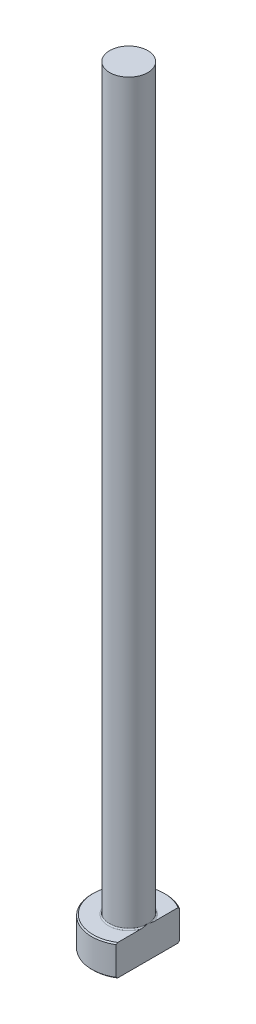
ISO-10303-21;
HEADER;
FILE_DESCRIPTION(('STEP AP214'),'2;1');
FILE_NAME('part.step','',(''),(''),'','','');
FILE_SCHEMA(('AUTOMOTIVE_DESIGN { 1 0 10303 214 1 1 1 1 }'));
ENDSEC;
DATA;
#1=APPLICATION_CONTEXT('core data for automotive mechanical design processes');
#2=APPLICATION_PROTOCOL_DEFINITION('international standard','automotive_design',2000,#1);
#3=PRODUCT_CONTEXT('',#1,'mechanical');
#4=PRODUCT('Part','Part','',(#3));
#5=PRODUCT_RELATED_PRODUCT_CATEGORY('part','',(#4));
#6=PRODUCT_DEFINITION_FORMATION('','',#4);
#7=PRODUCT_DEFINITION_CONTEXT('part definition',#1,'design');
#8=PRODUCT_DEFINITION('design','',#6,#7);
#9=PRODUCT_DEFINITION_SHAPE('','',#8);
#10=(LENGTH_UNIT() NAMED_UNIT(*) SI_UNIT(.MILLI.,.METRE.));
#11=(NAMED_UNIT(*) PLANE_ANGLE_UNIT() SI_UNIT($,.RADIAN.));
#12=(NAMED_UNIT(*) SI_UNIT($,.STERADIAN.) SOLID_ANGLE_UNIT());
#13=UNCERTAINTY_MEASURE_WITH_UNIT(LENGTH_MEASURE(1.E-05),#10,'distance_accuracy_value','');
#14=(GEOMETRIC_REPRESENTATION_CONTEXT(3) GLOBAL_UNCERTAINTY_ASSIGNED_CONTEXT((#13)) GLOBAL_UNIT_ASSIGNED_CONTEXT((#10,
#11,#12)) REPRESENTATION_CONTEXT('',''));
#15=CARTESIAN_POINT('',(0.,0.,0.));
#16=DIRECTION('',(0.,0.,1.));
#17=DIRECTION('',(1.,0.,0.));
#18=AXIS2_PLACEMENT_3D('',#15,#16,#17);
#19=CARTESIAN_POINT('',(0.,0.,0.));
#20=DIRECTION('',(0.,-1.,0.));
#21=DIRECTION('',(0.,0.,-1.));
#22=AXIS2_PLACEMENT_3D('',#19,#20,#21);
#23=PLANE('',#22);
#24=CARTESIAN_POINT('',(0.,0.,0.));
#25=DIRECTION('',(0.,-1.,0.));
#26=DIRECTION('',(0.,0.,-1.));
#27=AXIS2_PLACEMENT_3D('',#24,#25,#26);
#28=CIRCLE('',#27,5.79999999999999);
#29=CARTESIAN_POINT('',(3.09999999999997,0.,4.90204039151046));
#30=VERTEX_POINT('',#29);
#31=CARTESIAN_POINT('',(3.09999999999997,0.,-4.90204039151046));
#32=VERTEX_POINT('',#31);
#33=EDGE_CURVE('E98',#30,#32,#28,.T.);
#34=ORIENTED_EDGE('',*,*,#33,.T.);
#35=DIRECTION('',(0.,0.,1.));
#36=VECTOR('',#35,1.);
#37=CARTESIAN_POINT('',(3.09999999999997,0.,-5.13711981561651));
#38=LINE('',#37,#36);
#39=EDGE_CURVE('E83',#32,#30,#38,.T.);
#40=ORIENTED_EDGE('',*,*,#39,.T.);
#41=EDGE_LOOP('',(#34,#40));
#42=FACE_BOUND('',#41,.T.);
#43=ADVANCED_FACE('F32',(#42),#23,.T.);
#44=CARTESIAN_POINT('',(0.,259.958771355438,0.));
#45=DIRECTION('',(0.,1.,0.));
#46=DIRECTION('',(0.,0.,1.));
#47=AXIS2_PLACEMENT_3D('',#44,#45,#46);
#48=CYLINDRICAL_SURFACE('',#47,5.99999999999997);
#49=CARTESIAN_POINT('',(0.,4.79999999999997,0.));
#50=DIRECTION('',(0.,1.,0.));
#51=DIRECTION('',(0.,0.,1.));
#52=AXIS2_PLACEMENT_3D('',#49,#50,#51);
#53=CIRCLE('',#52,5.99999999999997);
#54=CARTESIAN_POINT('',(3.09999999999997,4.79999999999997,5.13711981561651));
#55=VERTEX_POINT('',#54);
#56=CARTESIAN_POINT('',(3.09999999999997,4.79999999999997,-5.13711981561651));
#57=VERTEX_POINT('',#56);
#58=EDGE_CURVE('E104',#55,#57,#53,.F.);
#59=ORIENTED_EDGE('',*,*,#58,.T.);
#60=DIRECTION('',(0.,-1.,0.));
#61=VECTOR('',#60,1.);
#62=CARTESIAN_POINT('',(3.09999999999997,125.,-5.13711981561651));
#63=LINE('',#62,#61);
#64=CARTESIAN_POINT('',(3.09999999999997,0.199999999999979,-5.13711981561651));
#65=VERTEX_POINT('',#64);
#66=EDGE_CURVE('E183',#57,#65,#63,.T.);
#67=ORIENTED_EDGE('',*,*,#66,.T.);
#68=CARTESIAN_POINT('',(0.,0.199999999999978,0.));
#69=DIRECTION('',(0.,-1.,0.));
#70=DIRECTION('',(0.,0.,-1.));
#71=AXIS2_PLACEMENT_3D('',#68,#69,#70);
#72=CIRCLE('',#71,5.99999999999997);
#73=CARTESIAN_POINT('',(3.09999999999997,0.199999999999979,5.13711981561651));
#74=VERTEX_POINT('',#73);
#75=EDGE_CURVE('E100',#65,#74,#72,.F.);
#76=ORIENTED_EDGE('',*,*,#75,.T.);
#77=DIRECTION('',(0.,-1.,0.));
#78=VECTOR('',#77,1.);
#79=CARTESIAN_POINT('',(3.09999999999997,125.,5.13711981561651));
#80=LINE('',#79,#78);
#81=EDGE_CURVE('E93',#55,#74,#80,.T.);
#82=ORIENTED_EDGE('',*,*,#81,.F.);
#83=EDGE_LOOP('',(#59,#67,#76,#82));
#84=FACE_BOUND('',#83,.T.);
#85=ADVANCED_FACE('F158',(#84),#48,.T.);
#86=CARTESIAN_POINT('',(-5.99999999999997,5.,0.));
#87=DIRECTION('',(0.,1.,0.));
#88=DIRECTION('',(0.,0.,1.));
#89=AXIS2_PLACEMENT_3D('',#86,#87,#88);
#90=PLANE('',#89);
#91=CARTESIAN_POINT('',(0.,5.,0.));
#92=DIRECTION('',(0.,1.,0.));
#93=DIRECTION('',(0.,0.,1.));
#94=AXIS2_PLACEMENT_3D('',#91,#92,#93);
#95=CIRCLE('',#94,5.79999999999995);
#96=CARTESIAN_POINT('',(3.09999999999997,5.,-4.90204039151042));
#97=VERTEX_POINT('',#96);
#98=CARTESIAN_POINT('',(3.09999999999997,5.,4.90204039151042));
#99=VERTEX_POINT('',#98);
#100=EDGE_CURVE('E178',#97,#99,#95,.T.);
#101=ORIENTED_EDGE('',*,*,#100,.T.);
#102=DIRECTION('',(0.,0.,-1.));
#103=VECTOR('',#102,1.);
#104=CARTESIAN_POINT('',(3.09999999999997,5.,0.));
#105=LINE('',#104,#103);
#106=CARTESIAN_POINT('',(3.09999999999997,4.99999999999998,1.13137084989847));
#107=VERTEX_POINT('',#106);
#108=EDGE_CURVE('E57',#99,#107,#105,.T.);
#109=ORIENTED_EDGE('',*,*,#108,.T.);
#110=CARTESIAN_POINT('',(0.,5.,0.));
#111=DIRECTION('',(0.,1.,0.));
#112=DIRECTION('',(0.,0.,1.));
#113=AXIS2_PLACEMENT_3D('',#110,#111,#112);
#114=CIRCLE('',#113,3.29999999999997);
#115=CARTESIAN_POINT('',(3.09999999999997,4.99999999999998,-1.13137084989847));
#116=VERTEX_POINT('',#115);
#117=EDGE_CURVE('E107',#107,#116,#114,.F.);
#118=ORIENTED_EDGE('',*,*,#117,.T.);
#119=EDGE_CURVE('E136',#116,#97,#105,.T.);
#120=ORIENTED_EDGE('',*,*,#119,.T.);
#121=EDGE_LOOP('',(#101,#109,#118,#120));
#122=FACE_BOUND('',#121,.T.);
#123=ADVANCED_FACE('F147',(#122),#90,.T.);
#124=CARTESIAN_POINT('',(0.,5.,0.));
#125=DIRECTION('',(0.,-1.,0.));
#126=DIRECTION('',(0.,0.,-1.));
#127=AXIS2_PLACEMENT_3D('',#124,#125,#126);
#128=CONICAL_SURFACE('',#127,5.79999999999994,0.785398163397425);
#129=ORIENTED_EDGE('',*,*,#58,.F.);
#130=CARTESIAN_POINT('',(3.09999999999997,-0.920431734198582,11.3030314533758));
#131=CARTESIAN_POINT('',(3.09999999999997,-0.688619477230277,11.0626468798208));
#132=CARTESIAN_POINT('',(3.09999999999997,-0.457063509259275,10.822014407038));
#133=CARTESIAN_POINT('',(3.09999999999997,0.00539791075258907,10.340120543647));
#134=CARTESIAN_POINT('',(3.09999999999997,0.236303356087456,10.0988591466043));
#135=CARTESIAN_POINT('',(3.09999999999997,0.697410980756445,9.61548494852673));
#136=CARTESIAN_POINT('',(3.09999999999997,0.92761285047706,9.37337185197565));
#137=CARTESIAN_POINT('',(3.09999999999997,1.38702344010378,8.88820676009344));
#138=CARTESIAN_POINT('',(3.09999999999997,1.6162321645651,8.64515476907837));
#139=CARTESIAN_POINT('',(3.09999999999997,2.0694380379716,8.16208218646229));
#140=CARTESIAN_POINT('',(3.09999999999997,2.29345676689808,7.92208185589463));
#141=CARTESIAN_POINT('',(3.09999999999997,2.73992554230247,7.44062694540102));
#142=CARTESIAN_POINT('',(3.09999999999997,2.96237559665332,7.19917237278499));
#143=CARTESIAN_POINT('',(3.09999999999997,3.40516728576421,6.71440911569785));
#144=CARTESIAN_POINT('',(3.09999999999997,3.62550926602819,6.47110074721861));
#145=CARTESIAN_POINT('',(3.09999999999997,4.06338097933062,5.98197014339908));
#146=CARTESIAN_POINT('',(3.09999999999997,4.28091078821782,5.7361479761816));
#147=CARTESIAN_POINT('',(3.09999999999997,4.64723250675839,5.31542741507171));
#148=CARTESIAN_POINT('',(3.09999999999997,4.79703819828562,5.14141294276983));
#149=CARTESIAN_POINT('',(3.09999999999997,5.09412273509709,4.79120565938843));
#150=CARTESIAN_POINT('',(3.09999999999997,5.24140133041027,4.61501263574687));
#151=CARTESIAN_POINT('',(3.09999999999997,5.53400477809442,4.25808346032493));
#152=CARTESIAN_POINT('',(3.09999999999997,5.67929603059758,4.07731963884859));
#153=CARTESIAN_POINT('',(3.09999999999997,5.96506147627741,3.71208453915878));
#154=CARTESIAN_POINT('',(3.09999999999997,6.1055368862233,3.52761421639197));
#155=CARTESIAN_POINT('',(3.09999999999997,6.38162972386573,3.15098880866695));
#156=CARTESIAN_POINT('',(3.09999999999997,6.51715077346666,2.95876205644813));
#157=CARTESIAN_POINT('',(3.09999999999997,6.7126004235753,2.66498269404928));
#158=CARTESIAN_POINT('',(3.09999999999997,6.77649142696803,2.56607098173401));
#159=CARTESIAN_POINT('',(3.09999999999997,6.90093996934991,2.3661793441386));
#160=CARTESIAN_POINT('',(3.09999999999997,6.96149785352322,2.26519963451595));
#161=CARTESIAN_POINT('',(3.09999999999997,7.07778312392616,2.06197879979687));
#162=CARTESIAN_POINT('',(3.09999999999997,7.13355741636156,1.95976487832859));
#163=CARTESIAN_POINT('',(3.09999999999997,7.23993773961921,1.75269687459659));
#164=CARTESIAN_POINT('',(3.09999999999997,7.29054278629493,1.64784229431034));
#165=CARTESIAN_POINT('',(3.09999999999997,7.43232844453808,1.32937424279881));
#166=CARTESIAN_POINT('',(3.09999999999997,7.51393038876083,1.11110705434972));
#167=CARTESIAN_POINT('',(3.09999999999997,7.60389052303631,0.784181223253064));
#168=CARTESIAN_POINT('',(3.09999999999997,7.62802295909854,0.679829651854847));
#169=CARTESIAN_POINT('',(3.09999999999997,7.66638713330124,0.469284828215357));
#170=CARTESIAN_POINT('',(3.09999999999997,7.68061997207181,0.363091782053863));
#171=CARTESIAN_POINT('',(3.09999999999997,7.6981673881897,0.150218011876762));
#172=CARTESIAN_POINT('',(3.09999999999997,7.70152516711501,0.0435409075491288));
#173=CARTESIAN_POINT('',(3.09999999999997,7.6971936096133,-0.169591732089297));
#174=CARTESIAN_POINT('',(3.09999999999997,7.68950359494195,-0.276047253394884));
#175=CARTESIAN_POINT('',(3.09999999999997,7.66373252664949,-0.486880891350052));
#176=CARTESIAN_POINT('',(3.09999999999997,7.64572733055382,-0.591268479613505));
#177=CARTESIAN_POINT('',(3.09999999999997,7.60052536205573,-0.798013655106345));
#178=CARTESIAN_POINT('',(3.09999999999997,7.57332729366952,-0.900370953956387));
#179=CARTESIAN_POINT('',(3.09999999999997,7.5109439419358,-1.10330613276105));
#180=CARTESIAN_POINT('',(3.09999999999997,7.47570859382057,-1.20386840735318));
#181=CARTESIAN_POINT('',(3.09999999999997,7.39875968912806,-1.40242722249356));
#182=CARTESIAN_POINT('',(3.09999999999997,7.35704736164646,-1.50042424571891));
#183=CARTESIAN_POINT('',(3.09999999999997,7.22811120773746,-1.78198575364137));
#184=CARTESIAN_POINT('',(3.09999999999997,7.13397777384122,-1.96237556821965));
#185=CARTESIAN_POINT('',(3.09999999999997,6.93309444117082,-2.31605883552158));
#186=CARTESIAN_POINT('',(3.09999999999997,6.82632930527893,-2.48934337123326));
#187=CARTESIAN_POINT('',(3.09999999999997,6.60386158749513,-2.8309743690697));
#188=CARTESIAN_POINT('',(3.09999999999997,6.4881263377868,-2.99929937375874));
#189=CARTESIAN_POINT('',(3.09999999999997,6.25073506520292,-3.33155975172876));
#190=CARTESIAN_POINT('',(3.09999999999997,6.12908188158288,-3.4954971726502));
#191=CARTESIAN_POINT('',(3.09999999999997,5.87989164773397,-3.82213838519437));
#192=CARTESIAN_POINT('',(3.09999999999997,5.75229938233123,-3.98479985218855));
#193=CARTESIAN_POINT('',(3.09999999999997,5.49383773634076,-4.30751445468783));
#194=CARTESIAN_POINT('',(3.09999999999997,5.36296802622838,-4.46756732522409));
#195=CARTESIAN_POINT('',(3.09999999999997,5.09906242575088,-4.78523580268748));
#196=CARTESIAN_POINT('',(3.09999999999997,4.96603235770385,-4.94285625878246));
#197=CARTESIAN_POINT('',(3.09999999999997,4.69805373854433,-5.25645943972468));
#198=CARTESIAN_POINT('',(3.09999999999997,4.56310515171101,-5.41244213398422));
#199=CARTESIAN_POINT('',(3.09999999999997,4.20809430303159,-5.81877937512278));
#200=CARTESIAN_POINT('',(3.09999999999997,3.98681570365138,-6.06807041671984));
#201=CARTESIAN_POINT('',(3.09999999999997,3.54147161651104,-6.56415415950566));
#202=CARTESIAN_POINT('',(3.09999999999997,3.31740605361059,-6.81094679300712));
#203=CARTESIAN_POINT('',(3.09999999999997,2.86701901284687,-7.30287446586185));
#204=CARTESIAN_POINT('',(3.09999999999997,2.6406956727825,-7.54800779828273));
#205=CARTESIAN_POINT('',(3.09999999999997,2.18649425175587,-8.03682963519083));
#206=CARTESIAN_POINT('',(3.09999999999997,1.95861616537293,-8.28051813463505));
#207=CARTESIAN_POINT('',(3.09999999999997,1.51083453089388,-8.75699429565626));
#208=CARTESIAN_POINT('',(3.09999999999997,1.29097841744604,-8.98982656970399));
#209=CARTESIAN_POINT('',(3.09999999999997,0.850379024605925,-9.45465147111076));
#210=CARTESIAN_POINT('',(3.09999999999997,0.629635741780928,-9.68664409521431));
#211=CARTESIAN_POINT('',(3.09999999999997,0.187673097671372,-10.1496925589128));
#212=CARTESIAN_POINT('',(3.09999999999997,-0.0335454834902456,-10.3807491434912));
#213=CARTESIAN_POINT('',(3.09999999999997,-0.47657456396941,-10.8422904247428));
#214=CARTESIAN_POINT('',(3.09999999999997,-0.698385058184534,-11.0727751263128));
#215=CARTESIAN_POINT('',(3.09999999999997,-0.920431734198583,-11.3030314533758));
#216=B_SPLINE_CURVE_WITH_KNOTS('',3,(#130,#131,#132,#133,#134,#135,#136,#137,#138,#139,#140,
#141,#142,#143,#144,#145,#146,#147,#148,#149,#150,#151,#152,#153,#154,#155,#156,#157,#158,#159,
#160,#161,#162,#163,#164,#165,#166,#167,#168,#169,#170,#171,#172,#173,#174,#175,#176,#177,#178,
#179,#180,#181,#182,#183,#184,#185,#186,#187,#188,#189,#190,#191,#192,#193,#194,#195,#196,#197,
#198,#199,#200,#201,#202,#203,#204,#205,#206,#207,#208,#209,#210,#211,#212,#213,#214,#215),
.UNSPECIFIED.,.F.,.F.,(4,2,2,2,2,2,2,2,2,2,2,2,2,2,2,2,2,2,2,2,2,2,2,2,2,2,2,2,2,2,2,2,2,2,2,2,
2,2,2,2,2,2,4),(0.,1.00184641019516,2.00370311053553,3.00595078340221,4.00819385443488,
4.99310535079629,5.97801190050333,6.96275416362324,7.9474698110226,8.63629491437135,
9.32518776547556,10.0208755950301,10.7163863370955,11.421700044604,11.7749044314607,
12.1280721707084,12.4772435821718,12.8264813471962,13.5223439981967,13.8432758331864,
14.1641719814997,14.4837917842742,14.8034312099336,15.1207496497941,15.4381128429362,
15.757509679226,16.0768459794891,16.6863983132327,17.2966935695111,17.909326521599,
18.5216683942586,19.1418114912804,19.7620171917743,20.3807633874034,20.9995211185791,
21.9994842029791,22.9994743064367,24.000371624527,25.0012724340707,25.9619611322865,
26.9226535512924,27.8822998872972,28.8419379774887),.UNSPECIFIED.);
#217=EDGE_CURVE('E135',#55,#99,#216,.T.);
#218=ORIENTED_EDGE('',*,*,#217,.T.);
#219=ORIENTED_EDGE('',*,*,#100,.F.);
#220=EDGE_CURVE('E127',#97,#57,#216,.T.);
#221=ORIENTED_EDGE('',*,*,#220,.T.);
#222=EDGE_LOOP('',(#129,#218,#219,#221));
#223=FACE_BOUND('',#222,.T.);
#224=ADVANCED_FACE('F143',(#223),#128,.T.);
#225=CARTESIAN_POINT('',(0.,0.199999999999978,0.));
#226=DIRECTION('',(0.,1.,0.));
#227=DIRECTION('',(0.,0.,1.));
#228=AXIS2_PLACEMENT_3D('',#225,#226,#227);
#229=CONICAL_SURFACE('',#228,5.99999999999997,0.785398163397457);
#230=ORIENTED_EDGE('',*,*,#75,.F.);
#231=CARTESIAN_POINT('',(3.09999999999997,5.92043173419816,-11.3030314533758));
#232=CARTESIAN_POINT('',(3.09999999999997,5.68861947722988,-11.0626468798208));
#233=CARTESIAN_POINT('',(3.09999999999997,5.4570635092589,-10.8220144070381));
#234=CARTESIAN_POINT('',(3.09999999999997,4.99460208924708,-10.340120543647));
#235=CARTESIAN_POINT('',(3.09999999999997,4.76369664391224,-10.0988591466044));
#236=CARTESIAN_POINT('',(3.09999999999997,4.3025890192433,-9.61548494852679));
#237=CARTESIAN_POINT('',(3.09999999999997,4.0723871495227,-9.37337185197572));
#238=CARTESIAN_POINT('',(3.09999999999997,3.61297655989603,-8.88820676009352));
#239=CARTESIAN_POINT('',(3.09999999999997,3.38376783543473,-8.64515476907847));
#240=CARTESIAN_POINT('',(3.09999999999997,2.93056196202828,-8.1620821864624));
#241=CARTESIAN_POINT('',(3.09999999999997,2.70654323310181,-7.92208185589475));
#242=CARTESIAN_POINT('',(3.09999999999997,2.26007445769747,-7.44062694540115));
#243=CARTESIAN_POINT('',(3.09999999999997,2.03762440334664,-7.19917237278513));
#244=CARTESIAN_POINT('',(3.09999999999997,1.59483271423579,-6.71440911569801));
#245=CARTESIAN_POINT('',(3.09999999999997,1.37449073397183,-6.47110074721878));
#246=CARTESIAN_POINT('',(3.09999999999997,0.936619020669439,-5.98197014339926));
#247=CARTESIAN_POINT('',(3.09999999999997,0.719089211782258,-5.73614797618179));
#248=CARTESIAN_POINT('',(3.09999999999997,0.352767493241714,-5.3154274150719));
#249=CARTESIAN_POINT('',(3.09999999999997,0.20296180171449,-5.14141294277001));
#250=CARTESIAN_POINT('',(3.09999999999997,-0.0941227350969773,-4.7912056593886));
#251=CARTESIAN_POINT('',(3.09999999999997,-0.241401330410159,-4.61501263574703));
#252=CARTESIAN_POINT('',(3.09999999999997,-0.534004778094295,-4.25808346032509));
#253=CARTESIAN_POINT('',(3.09999999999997,-0.679296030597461,-4.07731963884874));
#254=CARTESIAN_POINT('',(3.09999999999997,-0.965061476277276,-3.71208453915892));
#255=CARTESIAN_POINT('',(3.09999999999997,-1.10553688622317,-3.52761421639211));
#256=CARTESIAN_POINT('',(3.09999999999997,-1.38162972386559,-3.15098880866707));
#257=CARTESIAN_POINT('',(3.09999999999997,-1.51715077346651,-2.95876205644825));
#258=CARTESIAN_POINT('',(3.09999999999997,-1.71260042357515,-2.6649826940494));
#259=CARTESIAN_POINT('',(3.09999999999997,-1.77649142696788,-2.56607098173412));
#260=CARTESIAN_POINT('',(3.09999999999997,-1.90093996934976,-2.36617934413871));
#261=CARTESIAN_POINT('',(3.09999999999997,-1.96149785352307,-2.26519963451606));
#262=CARTESIAN_POINT('',(3.09999999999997,-2.077783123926,-2.06197879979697));
#263=CARTESIAN_POINT('',(3.09999999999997,-2.13355741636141,-1.95976487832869));
#264=CARTESIAN_POINT('',(3.09999999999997,-2.23993773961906,-1.75269687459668));
#265=CARTESIAN_POINT('',(3.09999999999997,-2.29054278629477,-1.64784229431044));
#266=CARTESIAN_POINT('',(3.09999999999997,-2.43232844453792,-1.3293742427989));
#267=CARTESIAN_POINT('',(3.09999999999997,-2.51393038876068,-1.11110705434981));
#268=CARTESIAN_POINT('',(3.09999999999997,-2.60389052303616,-0.784181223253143));
#269=CARTESIAN_POINT('',(3.09999999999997,-2.62802295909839,-0.679829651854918));
#270=CARTESIAN_POINT('',(3.09999999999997,-2.66638713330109,-0.469284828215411));
#271=CARTESIAN_POINT('',(3.09999999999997,-2.68061997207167,-0.363091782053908));
#272=CARTESIAN_POINT('',(3.09999999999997,-2.69816738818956,-0.150218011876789));
#273=CARTESIAN_POINT('',(3.09999999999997,-2.70152516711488,-0.0435409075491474));
#274=CARTESIAN_POINT('',(3.09999999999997,-2.69719360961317,0.169591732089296));
#275=CARTESIAN_POINT('',(3.09999999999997,-2.68950359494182,0.276047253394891));
#276=CARTESIAN_POINT('',(3.09999999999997,-2.66373252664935,0.486880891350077));
#277=CARTESIAN_POINT('',(3.09999999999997,-2.64572733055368,0.591268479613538));
#278=CARTESIAN_POINT('',(3.09999999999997,-2.60052536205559,0.798013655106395));
#279=CARTESIAN_POINT('',(3.09999999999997,-2.57332729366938,0.900370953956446));
#280=CARTESIAN_POINT('',(3.09999999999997,-2.51094394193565,1.10330613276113));
#281=CARTESIAN_POINT('',(3.09999999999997,-2.47570859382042,1.20386840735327));
#282=CARTESIAN_POINT('',(3.09999999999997,-2.3987596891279,1.40242722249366));
#283=CARTESIAN_POINT('',(3.09999999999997,-2.3570473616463,1.50042424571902));
#284=CARTESIAN_POINT('',(3.09999999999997,-2.22811120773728,1.78198575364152));
#285=CARTESIAN_POINT('',(3.09999999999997,-2.13397777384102,1.96237556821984));
#286=CARTESIAN_POINT('',(3.09999999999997,-1.93309444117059,2.31605883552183));
#287=CARTESIAN_POINT('',(3.09999999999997,-1.82632930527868,2.48934337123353));
#288=CARTESIAN_POINT('',(3.09999999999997,-1.60386158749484,2.83097436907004));
#289=CARTESIAN_POINT('',(3.09999999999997,-1.48812633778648,2.99929937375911));
#290=CARTESIAN_POINT('',(3.09999999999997,-1.25073506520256,3.33155975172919));
#291=CARTESIAN_POINT('',(3.09999999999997,-1.1290818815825,3.49549717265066));
#292=CARTESIAN_POINT('',(3.09999999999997,-0.879891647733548,3.82213838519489));
#293=CARTESIAN_POINT('',(3.09999999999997,-0.752299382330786,3.9847998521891));
#294=CARTESIAN_POINT('',(3.09999999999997,-0.493837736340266,4.30751445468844));
#295=CARTESIAN_POINT('',(3.09999999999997,-0.362968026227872,4.46756732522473));
#296=CARTESIAN_POINT('',(3.09999999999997,-0.0990624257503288,4.78523580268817));
#297=CARTESIAN_POINT('',(3.09999999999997,0.0339676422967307,4.94285625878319));
#298=CARTESIAN_POINT('',(3.09999999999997,0.301946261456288,5.25645943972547));
#299=CARTESIAN_POINT('',(3.09999999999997,0.436894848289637,5.41244213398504));
#300=CARTESIAN_POINT('',(3.09999999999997,0.79190569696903,5.81877937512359));
#301=CARTESIAN_POINT('',(3.09999999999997,1.0131842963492,6.06807041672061));
#302=CARTESIAN_POINT('',(3.09999999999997,1.45852838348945,6.56415415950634));
#303=CARTESIAN_POINT('',(3.09999999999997,1.68259394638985,6.81094679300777));
#304=CARTESIAN_POINT('',(3.09999999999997,2.13298098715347,7.30287446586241));
#305=CARTESIAN_POINT('',(3.09999999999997,2.3593043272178,7.54800779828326));
#306=CARTESIAN_POINT('',(3.09999999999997,2.81350574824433,8.03682963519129));
#307=CARTESIAN_POINT('',(3.09999999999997,3.04138383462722,8.28051813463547));
#308=CARTESIAN_POINT('',(3.09999999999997,3.48916546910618,8.7569942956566));
#309=CARTESIAN_POINT('',(3.09999999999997,3.70902158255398,8.98982656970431));
#310=CARTESIAN_POINT('',(3.09999999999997,4.14962097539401,9.45465147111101));
#311=CARTESIAN_POINT('',(3.09999999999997,4.37036425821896,9.68664409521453));
#312=CARTESIAN_POINT('',(3.09999999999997,4.81232690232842,10.1496925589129));
#313=CARTESIAN_POINT('',(3.09999999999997,5.03354548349,10.3807491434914));
#314=CARTESIAN_POINT('',(3.09999999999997,5.47657456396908,10.8422904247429));
#315=CARTESIAN_POINT('',(3.09999999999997,5.69838505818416,11.0727751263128));
#316=CARTESIAN_POINT('',(3.09999999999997,5.92043173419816,11.3030314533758));
#317=B_SPLINE_CURVE_WITH_KNOTS('',3,(#231,#232,#233,#234,#235,#236,#237,#238,#239,#240,#241,
#242,#243,#244,#245,#246,#247,#248,#249,#250,#251,#252,#253,#254,#255,#256,#257,#258,#259,#260,
#261,#262,#263,#264,#265,#266,#267,#268,#269,#270,#271,#272,#273,#274,#275,#276,#277,#278,#279,
#280,#281,#282,#283,#284,#285,#286,#287,#288,#289,#290,#291,#292,#293,#294,#295,#296,#297,#298,
#299,#300,#301,#302,#303,#304,#305,#306,#307,#308,#309,#310,#311,#312,#313,#314,#315,#316),
.UNSPECIFIED.,.F.,.F.,(4,2,2,2,2,2,2,2,2,2,2,2,2,2,2,2,2,2,2,2,2,2,2,2,2,2,2,2,2,2,2,2,2,2,2,2,
2,2,2,2,2,2,4),(0.,1.00184641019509,2.0037031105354,3.00595078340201,4.00819385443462,
4.99310535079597,5.97801190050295,6.9627541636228,7.9474698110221,8.63629491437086,
9.32518776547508,10.0208755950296,10.716386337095,11.4217000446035,11.7749044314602,
12.128072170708,12.4772435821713,12.8264813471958,13.5223439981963,13.843275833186,
14.1641719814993,14.4837917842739,14.8034312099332,15.1207496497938,15.438112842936,
15.7575096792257,16.0768459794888,16.6863983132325,17.296693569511,17.9093265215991,
18.5216683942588,19.1418114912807,19.7620171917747,20.3807633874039,20.9995211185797,
21.9994842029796,22.999474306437,24.0003716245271,25.0012724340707,25.9619611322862,
26.922653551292,27.8822998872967,28.841937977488),.UNSPECIFIED.);
#318=EDGE_CURVE('E86',#65,#32,#317,.T.);
#319=ORIENTED_EDGE('',*,*,#318,.T.);
#320=ORIENTED_EDGE('',*,*,#33,.F.);
#321=EDGE_CURVE('E89',#30,#74,#317,.T.);
#322=ORIENTED_EDGE('',*,*,#321,.T.);
#323=EDGE_LOOP('',(#230,#319,#320,#322));
#324=FACE_BOUND('',#323,.T.);
#325=ADVANCED_FACE('F97',(#324),#229,.T.);
#326=CARTESIAN_POINT('',(0.,5.19999999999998,0.));
#327=DIRECTION('',(0.,1.,0.));
#328=DIRECTION('',(0.,0.,1.));
#329=AXIS2_PLACEMENT_3D('',#326,#327,#328);
#330=TOROIDAL_SURFACE('',#329,3.29999999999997,0.2);
#331=CARTESIAN_POINT('',(3.09999999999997,5.19999999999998,0.));
#332=CARTESIAN_POINT('',(3.09999999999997,5.20000050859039,8.63470448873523E-11));
#333=CARTESIAN_POINT('',(3.09999999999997,5.20000101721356,-1.96831350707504E-07));
#334=CARTESIAN_POINT('',(3.09999999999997,5.20000196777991,-7.43387548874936E-07));
#335=CARTESIAN_POINT('',(3.09999999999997,5.20000239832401,-1.10608751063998E-06));
#336=CARTESIAN_POINT('',(3.09999999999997,5.20000329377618,-1.97482885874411E-06));
#337=CARTESIAN_POINT('',(3.09999999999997,5.20000374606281,-2.49491365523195E-06));
#338=CARTESIAN_POINT('',(3.09999999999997,5.20000455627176,-3.57320004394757E-06));
#339=CARTESIAN_POINT('',(3.09999999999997,5.20000491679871,-4.12959627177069E-06));
#340=CARTESIAN_POINT('',(3.09999999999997,5.20000625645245,-6.28443543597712E-06));
#341=CARTESIAN_POINT('',(3.09999999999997,5.20000716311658,-7.93057681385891E-06));
#342=CARTESIAN_POINT('',(3.09999999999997,5.20000865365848,-1.11908861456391E-05));
#343=CARTESIAN_POINT('',(3.09999999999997,5.20000925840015,-1.27959111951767E-05));
#344=CARTESIAN_POINT('',(3.09999999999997,5.20001179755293,-1.95895744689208E-05));
#345=CARTESIAN_POINT('',(3.09999999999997,5.20001369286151,-2.47960258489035E-05));
#346=CARTESIAN_POINT('',(3.09999999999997,5.20001648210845,-3.46313916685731E-05));
#347=CARTESIAN_POINT('',(3.09999999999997,5.20001748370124,-3.9229578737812E-05));
#348=CARTESIAN_POINT('',(3.09999999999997,5.20002478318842,-7.34062169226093E-05));
#349=CARTESIAN_POINT('',(3.09999999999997,5.20003031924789,-0.000103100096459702));
#350=CARTESIAN_POINT('',(3.09999999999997,5.20005455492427,-0.000220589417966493));
#351=CARTESIAN_POINT('',(3.09999999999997,5.2000776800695,-0.000307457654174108));
#352=CARTESIAN_POINT('',(3.09999999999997,5.20016786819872,-0.000651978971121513));
#353=CARTESIAN_POINT('',(3.09999999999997,5.20023206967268,-0.000910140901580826));
#354=CARTESIAN_POINT('',(3.09999999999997,5.2004894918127,-0.00193760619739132));
#355=CARTESIAN_POINT('',(3.09999999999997,5.20068632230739,-0.00270624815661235));
#356=CARTESIAN_POINT('',(3.09999999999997,5.20150547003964,-0.00591366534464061));
#357=CARTESIAN_POINT('',(3.09999999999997,5.20212323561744,-0.00835327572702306));
#358=CARTESIAN_POINT('',(3.09999999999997,5.2072994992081,-0.0287840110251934));
#359=CARTESIAN_POINT('',(3.09999999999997,5.21187465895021,-0.046772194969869));
#360=CARTESIAN_POINT('',(3.09999999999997,5.22081406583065,-0.0820386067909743));
#361=CARTESIAN_POINT('',(3.09999999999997,5.22517945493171,-0.0993165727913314));
#362=CARTESIAN_POINT('',(3.09999999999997,5.23938711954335,-0.155760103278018));
#363=CARTESIAN_POINT('',(3.09999999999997,5.24916620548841,-0.19494192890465));
#364=CARTESIAN_POINT('',(3.09999999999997,5.26559812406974,-0.262010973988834));
#365=CARTESIAN_POINT('',(3.09999999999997,5.27233495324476,-0.289877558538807));
#366=CARTESIAN_POINT('',(3.09999999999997,5.28539894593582,-0.344925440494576));
#367=CARTESIAN_POINT('',(3.09999999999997,5.2917322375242,-0.372105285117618));
#368=CARTESIAN_POINT('',(3.09999999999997,5.3104657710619,-0.454441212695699));
#369=CARTESIAN_POINT('',(3.09999999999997,5.32242624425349,-0.509699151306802));
#370=CARTESIAN_POINT('',(3.09999999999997,5.34470875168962,-0.621095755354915));
#371=CARTESIAN_POINT('',(3.09999999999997,5.35501420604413,-0.677237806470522));
#372=CARTESIAN_POINT('',(3.09999999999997,5.37397233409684,-0.795308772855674));
#373=CARTESIAN_POINT('',(3.09999999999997,5.38237372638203,-0.857279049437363));
#374=CARTESIAN_POINT('',(3.09999999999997,5.39483964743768,-0.981488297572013));
#375=CARTESIAN_POINT('',(3.09999999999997,5.39891956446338,-1.04372551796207));
#376=CARTESIAN_POINT('',(3.09999999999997,5.4002522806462,-1.1364625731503));
#377=CARTESIAN_POINT('',(3.09999999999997,5.39992868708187,-1.16692514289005));
#378=CARTESIAN_POINT('',(3.09999999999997,5.39736890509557,-1.22783403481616));
#379=CARTESIAN_POINT('',(3.09999999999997,5.39512949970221,-1.25828024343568));
#380=CARTESIAN_POINT('',(3.09999999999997,5.3882758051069,-1.31816284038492));
#381=CARTESIAN_POINT('',(3.09999999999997,5.38372059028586,-1.34760578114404));
#382=CARTESIAN_POINT('',(3.09999999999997,5.37149785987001,-1.40581436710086));
#383=CARTESIAN_POINT('',(3.09999999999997,5.36383981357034,-1.43458179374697));
#384=CARTESIAN_POINT('',(3.09999999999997,5.34913051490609,-1.47610977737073));
#385=CARTESIAN_POINT('',(3.09999999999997,5.34380195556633,-1.48947638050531));
#386=CARTESIAN_POINT('',(3.09999999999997,5.33179609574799,-1.51565425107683));
#387=CARTESIAN_POINT('',(3.09999999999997,5.32511527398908,-1.52846396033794));
#388=CARTESIAN_POINT('',(3.09999999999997,5.31156812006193,-1.55058530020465));
#389=CARTESIAN_POINT('',(3.09999999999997,5.30500876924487,-1.56008264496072));
#390=CARTESIAN_POINT('',(3.09999999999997,5.29056237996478,-1.5780097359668));
#391=CARTESIAN_POINT('',(3.09999999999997,5.28267975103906,-1.58644287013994));
#392=CARTESIAN_POINT('',(3.09999999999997,5.26899499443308,-1.59836257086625));
#393=CARTESIAN_POINT('',(3.09999999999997,5.26370979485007,-1.60243897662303));
#394=CARTESIAN_POINT('',(3.09999999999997,5.25259769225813,-1.60977856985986));
#395=CARTESIAN_POINT('',(3.09999999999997,5.24677147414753,-1.61304276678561));
#396=CARTESIAN_POINT('',(3.09999999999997,5.23558966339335,-1.61807105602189));
#397=CARTESIAN_POINT('',(3.09999999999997,5.23030479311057,-1.61999055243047));
#398=CARTESIAN_POINT('',(3.09999999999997,5.21948724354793,-1.62291762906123));
#399=CARTESIAN_POINT('',(3.09999999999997,5.21395478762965,-1.62392601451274));
#400=CARTESIAN_POINT('',(3.09999999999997,5.20277366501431,-1.62493544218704));
#401=CARTESIAN_POINT('',(3.09999999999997,5.19712461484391,-1.62493233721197));
#402=CARTESIAN_POINT('',(3.09999999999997,5.18591949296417,-1.62390846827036));
#403=CARTESIAN_POINT('',(3.09999999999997,5.1803634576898,-1.62288731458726));
#404=CARTESIAN_POINT('',(3.09999999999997,5.16982009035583,-1.62001450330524));
#405=CARTESIAN_POINT('',(3.09999999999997,5.16481843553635,-1.61821408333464));
#406=CARTESIAN_POINT('',(3.09999999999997,5.15512149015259,-1.61392929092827));
#407=CARTESIAN_POINT('',(3.09999999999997,5.15042629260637,-1.61144471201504));
#408=CARTESIAN_POINT('',(3.09999999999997,5.13843536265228,-1.60413057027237));
#409=CARTESIAN_POINT('',(3.09999999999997,5.13143004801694,-1.59882575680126));
#410=CARTESIAN_POINT('',(3.09999999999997,5.11831643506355,-1.5871999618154));
#411=CARTESIAN_POINT('',(3.09999999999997,5.1122112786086,-1.58087557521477));
#412=CARTESIAN_POINT('',(3.09999999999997,5.09648912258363,-1.56251896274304));
#413=CARTESIAN_POINT('',(3.09999999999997,5.08770172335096,-1.54978301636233));
#414=CARTESIAN_POINT('',(3.09999999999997,5.07201622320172,-1.52323986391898));
#415=CARTESIAN_POINT('',(3.09999999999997,5.06512028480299,-1.50943145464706));
#416=CARTESIAN_POINT('',(3.09999999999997,5.05247518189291,-1.48047677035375));
#417=CARTESIAN_POINT('',(3.09999999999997,5.04680124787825,-1.46529814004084));
#418=CARTESIAN_POINT('',(3.09999999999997,5.03672275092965,-1.43451819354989));
#419=CARTESIAN_POINT('',(3.09999999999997,5.03231964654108,-1.41891641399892));
#420=CARTESIAN_POINT('',(3.09999999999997,5.02058030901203,-1.37142005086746));
#421=CARTESIAN_POINT('',(3.09999999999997,5.01483238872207,-1.3391366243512));
#422=CARTESIAN_POINT('',(3.09999999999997,5.00376797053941,-1.25503165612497));
#423=CARTESIAN_POINT('',(3.09999999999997,5.00071471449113,-1.20294070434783));
#424=CARTESIAN_POINT('',(3.09999999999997,4.99950954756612,-1.09856941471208));
#425=CARTESIAN_POINT('',(3.09999999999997,5.00137734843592,-1.04628915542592));
#426=CARTESIAN_POINT('',(3.09999999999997,5.00844280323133,-0.944923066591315));
#427=CARTESIAN_POINT('',(3.09999999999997,5.01344756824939,-0.895822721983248));
#428=CARTESIAN_POINT('',(3.09999999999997,5.02575896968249,-0.798308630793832));
#429=CARTESIAN_POINT('',(3.09999999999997,5.03304750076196,-0.749892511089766));
#430=CARTESIAN_POINT('',(3.09999999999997,5.04953811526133,-0.652335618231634));
#431=CARTESIAN_POINT('',(3.09999999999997,5.05877753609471,-0.603201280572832));
#432=CARTESIAN_POINT('',(3.09999999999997,5.07884455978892,-0.503941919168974));
#433=CARTESIAN_POINT('',(3.09999999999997,5.08970698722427,-0.453824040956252));
#434=CARTESIAN_POINT('',(3.09999999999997,5.10895219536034,-0.369008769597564));
#435=CARTESIAN_POINT('',(3.09999999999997,5.11708529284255,-0.334253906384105));
#436=CARTESIAN_POINT('',(3.09999999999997,5.13360118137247,-0.265211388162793));
#437=CARTESIAN_POINT('',(3.09999999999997,5.14198019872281,-0.230922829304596));
#438=CARTESIAN_POINT('',(3.09999999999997,5.15798158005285,-0.16629806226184));
#439=CARTESIAN_POINT('',(3.09999999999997,5.16558151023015,-0.135956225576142));
#440=CARTESIAN_POINT('',(3.09999999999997,5.1812139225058,-0.0740081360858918));
#441=CARTESIAN_POINT('',(3.09999999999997,5.18925105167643,-0.0424030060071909));
#442=CARTESIAN_POINT('',(3.09999999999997,5.19787768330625,-0.0083493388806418));
#443=CARTESIAN_POINT('',(3.09999999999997,5.1984965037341,-0.00590581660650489));
#444=CARTESIAN_POINT('',(3.09999999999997,5.19931589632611,-0.00269751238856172));
#445=CARTESIAN_POINT('',(3.09999999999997,5.19951194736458,-0.00193190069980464));
#446=CARTESIAN_POINT('',(3.09999999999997,5.1997684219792,-0.000908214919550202));
#447=CARTESIAN_POINT('',(3.09999999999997,5.19983243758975,-0.000650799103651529));
#448=CARTESIAN_POINT('',(3.09999999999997,5.19992240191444,-0.00030714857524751));
#449=CARTESIAN_POINT('',(3.09999999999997,5.19994549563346,-0.000220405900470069));
#450=CARTESIAN_POINT('',(3.09999999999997,5.19996970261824,-0.000103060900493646));
#451=CARTESIAN_POINT('',(3.09999999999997,5.19997523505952,-7.33845004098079E-05));
#452=CARTESIAN_POINT('',(3.09999999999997,5.19998252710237,-3.92257131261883E-05));
#453=CARTESIAN_POINT('',(3.09999999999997,5.19998352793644,-3.462848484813E-05));
#454=CARTESIAN_POINT('',(3.09999999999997,5.1999863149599,-2.4795096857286E-05));
#455=CARTESIAN_POINT('',(3.09999999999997,5.19998820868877,-1.95896135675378E-05));
#456=CARTESIAN_POINT('',(3.09999999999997,5.19999074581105,-1.2796958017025E-05));
#457=CARTESIAN_POINT('',(3.09999999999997,5.1999913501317,-1.11920046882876E-05));
#458=CARTESIAN_POINT('',(3.09999999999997,5.19999283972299,-7.93177065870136E-06));
#459=CARTESIAN_POINT('',(3.09999999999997,5.19999374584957,-6.28562370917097E-06));
#460=CARTESIAN_POINT('',(3.09999999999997,5.19999508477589,-4.13069797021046E-06));
#461=CARTESIAN_POINT('',(3.09999999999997,5.1999954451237,-3.57425625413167E-06));
#462=CARTESIAN_POINT('',(3.09999999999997,5.19999625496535,-2.49584654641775E-06));
#463=CARTESIAN_POINT('',(3.09999999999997,5.19999670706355,-1.97568269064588E-06));
#464=CARTESIAN_POINT('',(3.09999999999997,5.19999760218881,-1.10675611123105E-06));
#465=CARTESIAN_POINT('',(3.09999999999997,5.19999803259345,-7.4395710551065E-07));
#466=CARTESIAN_POINT('',(3.09999999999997,5.19999898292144,-1.97149804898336E-07));
#467=CARTESIAN_POINT('',(3.09999999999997,5.19999949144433,-8.63411446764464E-11));
#468=CARTESIAN_POINT('',(3.09999999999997,5.19999999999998,0.));
#469=B_SPLINE_CURVE_WITH_KNOTS('',3,(#331,#332,#333,#334,#335,#336,#337,#338,#339,#340,#341,
#342,#343,#344,#345,#346,#347,#348,#349,#350,#351,#352,#353,#354,#355,#356,#357,#358,#359,#360,
#361,#362,#363,#364,#365,#366,#367,#368,#369,#370,#371,#372,#373,#374,#375,#376,#377,#378,#379,
#380,#381,#382,#383,#384,#385,#386,#387,#388,#389,#390,#391,#392,#393,#394,#395,#396,#397,#398,
#399,#400,#401,#402,#403,#404,#405,#406,#407,#408,#409,#410,#411,#412,#413,#414,#415,#416,#417,
#418,#419,#420,#421,#422,#423,#424,#425,#426,#427,#428,#429,#430,#431,#432,#433,#434,#435,#436,
#437,#438,#439,#440,#441,#442,#443,#444,#445,#446,#447,#448,#449,#450,#451,#452,#453,#454,#455,
#456,#457,#458,#459,#460,#461,#462,#463,#464,#465,#466,#467,#468),.UNSPECIFIED.,.T.,.F.,(4,2,2,
2,2,2,2,2,2,2,2,2,2,2,2,2,2,2,2,2,2,2,2,2,2,2,2,2,2,2,2,2,2,2,2,2,2,2,2,2,2,2,2,2,2,2,2,2,2,2,2,
2,2,2,2,2,2,2,2,2,2,2,2,2,2,2,2,2,4),(0.,1.53981331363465E-06,3.23033975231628E-06,
5.28553578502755E-06,7.27344647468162E-06,1.28910817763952E-05,1.8031960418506E-05,
3.46255039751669E-05,4.8726433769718E-05,0.000139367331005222,0.000408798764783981,
0.0012071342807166,0.00358714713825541,0.0111373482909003,0.0668184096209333,0.120281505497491,
0.241431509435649,0.327438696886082,0.411161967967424,0.580755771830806,0.751954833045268,
0.939477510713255,1.12633017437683,1.21767988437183,1.30918328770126,1.39846159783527,
1.48746947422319,1.53058836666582,1.57382101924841,1.60836719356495,1.64280045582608,
1.66276990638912,1.68271441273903,1.69951299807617,1.71629672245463,1.73314926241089,
1.75000825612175,1.76589594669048,1.78178843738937,1.80799762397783,1.83429622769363,
1.88045465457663,1.9266656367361,1.97520355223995,2.02379695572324,2.12194851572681,
2.27811623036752,2.43491043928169,2.58289937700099,2.7297435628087,2.87970504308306,
3.03353547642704,3.14061512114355,3.24650617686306,3.34034416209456,3.4381742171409,
3.44573655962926,3.44810718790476,3.44890321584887,3.44917225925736,3.44926284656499,
3.44927694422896,3.44929353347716,3.44929867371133,3.44930429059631,3.44930627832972,
3.44930833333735,3.44931002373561,3.4493115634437),.UNSPECIFIED.);
#470=CARTESIAN_POINT('',(3.09999999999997,5.19999999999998,0.));
#471=VERTEX_POINT('',#470);
#472=EDGE_CURVE('E11',#116,#471,#469,.T.);
#473=ORIENTED_EDGE('',*,*,#472,.F.);
#474=ORIENTED_EDGE('',*,*,#117,.F.);
#475=CARTESIAN_POINT('',(3.09999999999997,5.19999999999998,0.));
#476=CARTESIAN_POINT('',(3.09999999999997,5.19999949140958,-8.63470557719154E-11));
#477=CARTESIAN_POINT('',(3.09999999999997,5.19999898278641,1.96831350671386E-07));
#478=CARTESIAN_POINT('',(3.09999999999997,5.19999803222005,7.43387548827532E-07));
#479=CARTESIAN_POINT('',(3.09999999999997,5.19999760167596,1.10608751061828E-06));
#480=CARTESIAN_POINT('',(3.09999999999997,5.19999670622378,1.97482885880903E-06));
#481=CARTESIAN_POINT('',(3.09999999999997,5.19999625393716,2.49491365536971E-06));
#482=CARTESIAN_POINT('',(3.09999999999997,5.1999954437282,3.57320004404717E-06));
#483=CARTESIAN_POINT('',(3.09999999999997,5.19999508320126,4.12959627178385E-06));
#484=CARTESIAN_POINT('',(3.09999999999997,5.19999374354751,6.28443543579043E-06));
#485=CARTESIAN_POINT('',(3.09999999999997,5.19999283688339,7.93057681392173E-06));
#486=CARTESIAN_POINT('',(3.09999999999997,5.19999134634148,1.1190886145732E-05));
#487=CARTESIAN_POINT('',(3.09999999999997,5.19999074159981,1.27959111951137E-05));
#488=CARTESIAN_POINT('',(3.09999999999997,5.19998820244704,1.95895744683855E-05));
#489=CARTESIAN_POINT('',(3.09999999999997,5.19998630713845,2.47960258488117E-05));
#490=CARTESIAN_POINT('',(3.09999999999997,5.19998351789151,3.4631391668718E-05));
#491=CARTESIAN_POINT('',(3.09999999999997,5.19998251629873,3.9229578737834E-05));
#492=CARTESIAN_POINT('',(3.09999999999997,5.19997521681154,7.34062169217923E-05));
#493=CARTESIAN_POINT('',(3.09999999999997,5.19996968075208,0.000103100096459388));
#494=CARTESIAN_POINT('',(3.09999999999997,5.1999454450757,0.000220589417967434));
#495=CARTESIAN_POINT('',(3.09999999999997,5.19992231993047,0.000307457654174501));
#496=CARTESIAN_POINT('',(3.09999999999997,5.19983213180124,0.000651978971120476));
#497=CARTESIAN_POINT('',(3.09999999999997,5.19976793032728,0.00091014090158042));
#498=CARTESIAN_POINT('',(3.09999999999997,5.19951050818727,0.00193760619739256));
#499=CARTESIAN_POINT('',(3.09999999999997,5.19931367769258,0.00270624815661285));
#500=CARTESIAN_POINT('',(3.09999999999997,5.19849452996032,0.00591366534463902));
#501=CARTESIAN_POINT('',(3.09999999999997,5.19787676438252,0.00835327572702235));
#502=CARTESIAN_POINT('',(3.09999999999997,5.19270050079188,0.0287840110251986));
#503=CARTESIAN_POINT('',(3.09999999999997,5.18812534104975,0.0467721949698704));
#504=CARTESIAN_POINT('',(3.09999999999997,5.17918593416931,0.0820386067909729));
#505=CARTESIAN_POINT('',(3.09999999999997,5.17482054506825,0.0993165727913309));
#506=CARTESIAN_POINT('',(3.09999999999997,5.16061288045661,0.15576010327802));
#507=CARTESIAN_POINT('',(3.09999999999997,5.15083379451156,0.194941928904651));
#508=CARTESIAN_POINT('',(3.09999999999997,5.13440187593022,0.262010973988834));
#509=CARTESIAN_POINT('',(3.09999999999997,5.12766504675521,0.289877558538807));
#510=CARTESIAN_POINT('',(3.09999999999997,5.11460105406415,0.344925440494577));
#511=CARTESIAN_POINT('',(3.09999999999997,5.10826776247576,0.372105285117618));
#512=CARTESIAN_POINT('',(3.09999999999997,5.08953422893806,0.454441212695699));
#513=CARTESIAN_POINT('',(3.09999999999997,5.07757375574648,0.509699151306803));
#514=CARTESIAN_POINT('',(3.09999999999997,5.05529124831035,0.621095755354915));
#515=CARTESIAN_POINT('',(3.09999999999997,5.04498579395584,0.677237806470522));
#516=CARTESIAN_POINT('',(3.09999999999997,5.02602766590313,0.795308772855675));
#517=CARTESIAN_POINT('',(3.09999999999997,5.01762627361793,0.857279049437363));
#518=CARTESIAN_POINT('',(3.09999999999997,5.00516035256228,0.981488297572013));
#519=CARTESIAN_POINT('',(3.09999999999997,5.00108043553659,1.04372551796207));
#520=CARTESIAN_POINT('',(3.09999999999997,4.99974771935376,1.1364625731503));
#521=CARTESIAN_POINT('',(3.09999999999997,5.0000713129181,1.16692514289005));
#522=CARTESIAN_POINT('',(3.09999999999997,5.00263109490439,1.22783403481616));
#523=CARTESIAN_POINT('',(3.09999999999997,5.00487050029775,1.25828024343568));
#524=CARTESIAN_POINT('',(3.09999999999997,5.01172419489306,1.31816284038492));
#525=CARTESIAN_POINT('',(3.09999999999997,5.0162794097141,1.34760578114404));
#526=CARTESIAN_POINT('',(3.09999999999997,5.02850214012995,1.40581436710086));
#527=CARTESIAN_POINT('',(3.09999999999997,5.03616018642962,1.43458179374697));
#528=CARTESIAN_POINT('',(3.09999999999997,5.05086948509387,1.47610977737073));
#529=CARTESIAN_POINT('',(3.09999999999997,5.05619804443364,1.48947638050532));
#530=CARTESIAN_POINT('',(3.09999999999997,5.06820390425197,1.51565425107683));
#531=CARTESIAN_POINT('',(3.09999999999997,5.07488472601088,1.52846396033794));
#532=CARTESIAN_POINT('',(3.09999999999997,5.08843187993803,1.55058530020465));
#533=CARTESIAN_POINT('',(3.09999999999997,5.0949912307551,1.56008264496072));
#534=CARTESIAN_POINT('',(3.09999999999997,5.10943762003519,1.5780097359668));
#535=CARTESIAN_POINT('',(3.09999999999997,5.11732024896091,1.58644287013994));
#536=CARTESIAN_POINT('',(3.09999999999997,5.13100500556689,1.59836257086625));
#537=CARTESIAN_POINT('',(3.09999999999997,5.1362902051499,1.60243897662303));
#538=CARTESIAN_POINT('',(3.09999999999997,5.14740230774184,1.60977856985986));
#539=CARTESIAN_POINT('',(3.09999999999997,5.15322852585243,1.61304276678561));
#540=CARTESIAN_POINT('',(3.09999999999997,5.16441033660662,1.61807105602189));
#541=CARTESIAN_POINT('',(3.09999999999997,5.16969520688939,1.61999055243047));
#542=CARTESIAN_POINT('',(3.09999999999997,5.18051275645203,1.62291762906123));
#543=CARTESIAN_POINT('',(3.09999999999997,5.18604521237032,1.62392601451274));
#544=CARTESIAN_POINT('',(3.09999999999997,5.19722633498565,1.62493544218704));
#545=CARTESIAN_POINT('',(3.09999999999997,5.20287538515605,1.62493233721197));
#546=CARTESIAN_POINT('',(3.09999999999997,5.21408050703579,1.62390846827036));
#547=CARTESIAN_POINT('',(3.09999999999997,5.21963654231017,1.62288731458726));
#548=CARTESIAN_POINT('',(3.09999999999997,5.23017990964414,1.62001450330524));
#549=CARTESIAN_POINT('',(3.09999999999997,5.23518156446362,1.61821408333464));
#550=CARTESIAN_POINT('',(3.09999999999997,5.24487850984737,1.61392929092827));
#551=CARTESIAN_POINT('',(3.09999999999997,5.2495737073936,1.61144471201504));
#552=CARTESIAN_POINT('',(3.09999999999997,5.26156463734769,1.60413057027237));
#553=CARTESIAN_POINT('',(3.09999999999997,5.26856995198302,1.59882575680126));
#554=CARTESIAN_POINT('',(3.09999999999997,5.28168356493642,1.5871999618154));
#555=CARTESIAN_POINT('',(3.09999999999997,5.28778872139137,1.58087557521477));
#556=CARTESIAN_POINT('',(3.09999999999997,5.30351087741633,1.56251896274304));
#557=CARTESIAN_POINT('',(3.09999999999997,5.312298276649,1.54978301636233));
#558=CARTESIAN_POINT('',(3.09999999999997,5.32798377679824,1.52323986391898));
#559=CARTESIAN_POINT('',(3.09999999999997,5.33487971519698,1.50943145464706));
#560=CARTESIAN_POINT('',(3.09999999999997,5.34752481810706,1.48047677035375));
#561=CARTESIAN_POINT('',(3.09999999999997,5.35319875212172,1.46529814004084));
#562=CARTESIAN_POINT('',(3.09999999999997,5.36327724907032,1.43451819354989));
#563=CARTESIAN_POINT('',(3.09999999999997,5.36768035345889,1.41891641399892));
#564=CARTESIAN_POINT('',(3.09999999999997,5.37941969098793,1.37142005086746));
#565=CARTESIAN_POINT('',(3.09999999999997,5.3851676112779,1.33913662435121));
#566=CARTESIAN_POINT('',(3.09999999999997,5.39623202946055,1.25503165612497));
#567=CARTESIAN_POINT('',(3.09999999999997,5.39928528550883,1.20294070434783));
#568=CARTESIAN_POINT('',(3.09999999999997,5.40049045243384,1.09856941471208));
#569=CARTESIAN_POINT('',(3.09999999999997,5.39862265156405,1.04628915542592));
#570=CARTESIAN_POINT('',(3.09999999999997,5.39155719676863,0.944923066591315));
#571=CARTESIAN_POINT('',(3.09999999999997,5.38655243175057,0.895822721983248));
#572=CARTESIAN_POINT('',(3.09999999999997,5.37424103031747,0.798308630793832));
#573=CARTESIAN_POINT('',(3.09999999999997,5.36695249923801,0.749892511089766));
#574=CARTESIAN_POINT('',(3.09999999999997,5.35046188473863,0.652335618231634));
#575=CARTESIAN_POINT('',(3.09999999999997,5.34122246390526,0.603201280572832));
#576=CARTESIAN_POINT('',(3.09999999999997,5.32115544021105,0.503941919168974));
#577=CARTESIAN_POINT('',(3.09999999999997,5.3102930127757,0.453824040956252));
#578=CARTESIAN_POINT('',(3.09999999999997,5.29104780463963,0.369008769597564));
#579=CARTESIAN_POINT('',(3.09999999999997,5.28291470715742,0.334253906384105));
#580=CARTESIAN_POINT('',(3.09999999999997,5.2663988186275,0.265211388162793));
#581=CARTESIAN_POINT('',(3.09999999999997,5.25801980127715,0.230922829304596));
#582=CARTESIAN_POINT('',(3.09999999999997,5.24201841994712,0.16629806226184));
#583=CARTESIAN_POINT('',(3.09999999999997,5.23441848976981,0.135956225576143));
#584=CARTESIAN_POINT('',(3.09999999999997,5.21878607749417,0.0740081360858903));
#585=CARTESIAN_POINT('',(3.09999999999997,5.21074894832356,0.0424030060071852));
#586=CARTESIAN_POINT('',(3.09999999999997,5.20212231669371,0.00834933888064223));
#587=CARTESIAN_POINT('',(3.09999999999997,5.20150349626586,0.00590581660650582));
#588=CARTESIAN_POINT('',(3.09999999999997,5.20068410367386,0.0026975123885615));
#589=CARTESIAN_POINT('',(3.09999999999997,5.20048805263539,0.00193190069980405));
#590=CARTESIAN_POINT('',(3.09999999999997,5.20023157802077,0.000908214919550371));
#591=CARTESIAN_POINT('',(3.09999999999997,5.20016756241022,0.000650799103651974));
#592=CARTESIAN_POINT('',(3.09999999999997,5.20007759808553,0.000307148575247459));
#593=CARTESIAN_POINT('',(3.09999999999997,5.20005450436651,0.000220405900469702));
#594=CARTESIAN_POINT('',(3.09999999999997,5.20003029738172,0.000103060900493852));
#595=CARTESIAN_POINT('',(3.09999999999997,5.20002476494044,7.33845004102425E-05));
#596=CARTESIAN_POINT('',(3.09999999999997,5.20001747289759,3.92257131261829E-05));
#597=CARTESIAN_POINT('',(3.09999999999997,5.20001647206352,3.46284848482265E-05));
#598=CARTESIAN_POINT('',(3.09999999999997,5.20001368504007,2.47950968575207E-05));
#599=CARTESIAN_POINT('',(3.09999999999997,5.20001179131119,1.95896135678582E-05));
#600=CARTESIAN_POINT('',(3.09999999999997,5.20000925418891,1.27969580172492E-05));
#601=CARTESIAN_POINT('',(3.09999999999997,5.20000864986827,1.11920046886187E-05));
#602=CARTESIAN_POINT('',(3.09999999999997,5.20000716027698,7.93177065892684E-06));
#603=CARTESIAN_POINT('',(3.09999999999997,5.20000625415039,6.28562370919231E-06));
#604=CARTESIAN_POINT('',(3.09999999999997,5.20000491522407,4.13069797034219E-06));
#605=CARTESIAN_POINT('',(3.09999999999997,5.20000455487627,3.57425625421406E-06));
#606=CARTESIAN_POINT('',(3.09999999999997,5.20000374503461,2.4958465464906E-06));
#607=CARTESIAN_POINT('',(3.09999999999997,5.20000329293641,1.97568269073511E-06));
#608=CARTESIAN_POINT('',(3.09999999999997,5.20000239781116,1.10675611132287E-06));
#609=CARTESIAN_POINT('',(3.09999999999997,5.20000196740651,7.43957105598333E-07));
#610=CARTESIAN_POINT('',(3.09999999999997,5.20000101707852,1.97149804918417E-07));
#611=CARTESIAN_POINT('',(3.09999999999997,5.20000050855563,8.63411555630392E-11));
#612=CARTESIAN_POINT('',(3.09999999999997,5.19999999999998,0.));
#613=B_SPLINE_CURVE_WITH_KNOTS('',3,(#475,#476,#477,#478,#479,#480,#481,#482,#483,#484,#485,
#486,#487,#488,#489,#490,#491,#492,#493,#494,#495,#496,#497,#498,#499,#500,#501,#502,#503,#504,
#505,#506,#507,#508,#509,#510,#511,#512,#513,#514,#515,#516,#517,#518,#519,#520,#521,#522,#523,
#524,#525,#526,#527,#528,#529,#530,#531,#532,#533,#534,#535,#536,#537,#538,#539,#540,#541,#542,
#543,#544,#545,#546,#547,#548,#549,#550,#551,#552,#553,#554,#555,#556,#557,#558,#559,#560,#561,
#562,#563,#564,#565,#566,#567,#568,#569,#570,#571,#572,#573,#574,#575,#576,#577,#578,#579,#580,
#581,#582,#583,#584,#585,#586,#587,#588,#589,#590,#591,#592,#593,#594,#595,#596,#597,#598,#599,
#600,#601,#602,#603,#604,#605,#606,#607,#608,#609,#610,#611,#612),.UNSPECIFIED.,.T.,.F.,(4,2,2,
2,2,2,2,2,2,2,2,2,2,2,2,2,2,2,2,2,2,2,2,2,2,2,2,2,2,2,2,2,2,2,2,2,2,2,2,2,2,2,2,2,2,2,2,2,2,2,2,
2,2,2,2,2,2,2,2,2,2,2,2,2,2,2,2,2,4),(0.,1.53981331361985E-06,3.23033975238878E-06,
5.28553578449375E-06,7.27344647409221E-06,1.28910817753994E-05,1.80319604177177E-05,
3.4625503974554E-05,4.87264337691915E-05,0.000139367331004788,0.000408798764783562,
0.00120713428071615,0.00358714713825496,0.0111373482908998,0.0668184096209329,0.120281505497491,
0.241431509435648,0.327438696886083,0.411161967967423,0.580755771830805,0.751954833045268,
0.939477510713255,1.12633017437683,1.21767988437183,1.30918328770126,1.39846159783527,
1.48746947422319,1.53058836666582,1.57382101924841,1.60836719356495,1.64280045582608,
1.66276990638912,1.68271441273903,1.69951299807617,1.71629672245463,1.73314926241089,
1.75000825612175,1.76589594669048,1.78178843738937,1.80799762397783,1.83429622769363,
1.88045465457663,1.9266656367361,1.97520355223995,2.02379695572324,2.12194851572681,
2.27811623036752,2.43491043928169,2.582899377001,2.7297435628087,2.87970504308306,
3.03353547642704,3.14061512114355,3.24650617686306,3.34034416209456,3.4381742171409,
3.44573655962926,3.44810718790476,3.44890321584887,3.44917225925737,3.44926284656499,
3.44927694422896,3.44929353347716,3.44929867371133,3.44930429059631,3.44930627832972,
3.44930833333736,3.44931002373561,3.4493115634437),.UNSPECIFIED.);
#614=EDGE_CURVE('E46',#471,#107,#613,.T.);
#615=ORIENTED_EDGE('',*,*,#614,.F.);
#616=CARTESIAN_POINT('',(0.,5.19999999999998,0.));
#617=DIRECTION('',(0.,1.,0.));
#618=DIRECTION('',(0.,0.,1.));
#619=AXIS2_PLACEMENT_3D('',#616,#617,#618);
#620=CIRCLE('',#619,3.09999999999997);
#621=EDGE_CURVE('E103',#471,#471,#620,.T.);
#622=ORIENTED_EDGE('',*,*,#621,.F.);
#623=EDGE_LOOP('',(#473,#474,#615,#622));
#624=FACE_BOUND('',#623,.T.);
#625=ADVANCED_FACE('F34',(#624),#330,.F.);
#626=CARTESIAN_POINT('',(0.,259.958771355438,0.));
#627=DIRECTION('',(0.,1.,0.));
#628=DIRECTION('',(0.,0.,1.));
#629=AXIS2_PLACEMENT_3D('',#626,#627,#628);
#630=CYLINDRICAL_SURFACE('',#629,3.09999999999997);
#631=ORIENTED_EDGE('',*,*,#621,.T.);
#632=EDGE_LOOP('',(#631));
#633=FACE_BOUND('',#632,.T.);
#634=CARTESIAN_POINT('',(0.,125.,0.));
#635=DIRECTION('',(0.,1.,0.));
#636=DIRECTION('',(0.,0.,1.));
#637=AXIS2_PLACEMENT_3D('',#634,#635,#636);
#638=CIRCLE('',#637,3.09999999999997);
#639=CARTESIAN_POINT('',(0.,125.,3.09999999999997));
#640=VERTEX_POINT('',#639);
#641=EDGE_CURVE('E101',#640,#640,#638,.T.);
#642=ORIENTED_EDGE('',*,*,#641,.F.);
#643=EDGE_LOOP('',(#642));
#644=FACE_BOUND('',#643,.T.);
#645=ADVANCED_FACE('F155',(#633,#644),#630,.T.);
#646=CARTESIAN_POINT('',(-3.09999999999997,125.,0.));
#647=DIRECTION('',(0.,1.,0.));
#648=DIRECTION('',(0.,0.,1.));
#649=AXIS2_PLACEMENT_3D('',#646,#647,#648);
#650=PLANE('',#649);
#651=ORIENTED_EDGE('',*,*,#641,.T.);
#652=EDGE_LOOP('',(#651));
#653=FACE_BOUND('',#652,.T.);
#654=ADVANCED_FACE('F121',(#653),#650,.T.);
#655=CARTESIAN_POINT('',(3.09999999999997,125.,-5.13711981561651));
#656=DIRECTION('',(1.,0.,0.));
#657=DIRECTION('',(0.,0.,-1.));
#658=AXIS2_PLACEMENT_3D('',#655,#656,#657);
#659=PLANE('',#658);
#660=ORIENTED_EDGE('',*,*,#66,.F.);
#661=ORIENTED_EDGE('',*,*,#220,.F.);
#662=ORIENTED_EDGE('',*,*,#119,.F.);
#663=ORIENTED_EDGE('',*,*,#472,.T.);
#664=ORIENTED_EDGE('',*,*,#614,.T.);
#665=ORIENTED_EDGE('',*,*,#108,.F.);
#666=ORIENTED_EDGE('',*,*,#217,.F.);
#667=ORIENTED_EDGE('',*,*,#81,.T.);
#668=ORIENTED_EDGE('',*,*,#321,.F.);
#669=ORIENTED_EDGE('',*,*,#39,.F.);
#670=ORIENTED_EDGE('',*,*,#318,.F.);
#671=EDGE_LOOP('',(#660,#661,#662,#663,#664,#665,#666,#667,#668,#669,#670));
#672=FACE_BOUND('',#671,.T.);
#673=ADVANCED_FACE('F85',(#672),#659,.T.);
#674=CLOSED_SHELL('',(#43,#85,#123,#224,#325,#625,#645,#654,#673));
#675=MANIFOLD_SOLID_BREP('B2',#674);
#676=ADVANCED_BREP_SHAPE_REPRESENTATION('',(#18,#675),#14);
#677=SHAPE_DEFINITION_REPRESENTATION(#9,#676);
ENDSEC;
END-ISO-10303-21;
